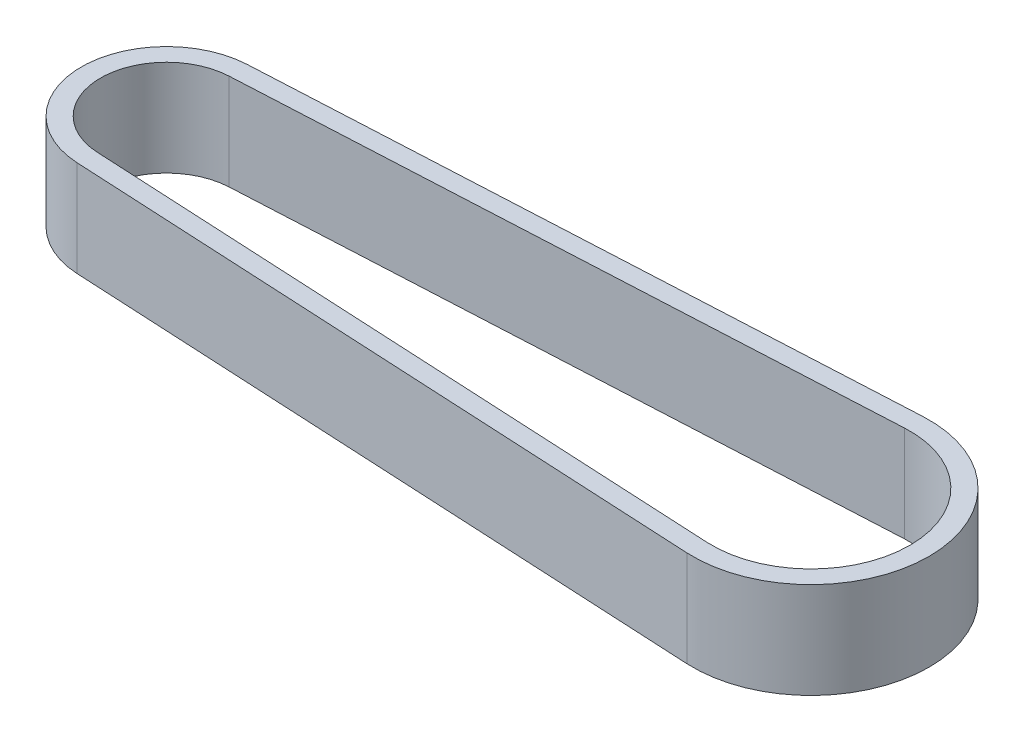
ISO-10303-21;
HEADER;
FILE_DESCRIPTION(('STEP AP214'),'2;1');
FILE_NAME('part.step','',(''),(''),'','','');
FILE_SCHEMA(('AUTOMOTIVE_DESIGN { 1 0 10303 214 1 1 1 1 }'));
ENDSEC;
DATA;
#1=APPLICATION_CONTEXT('core data for automotive mechanical design processes');
#2=APPLICATION_PROTOCOL_DEFINITION('international standard','automotive_design',2000,#1);
#3=PRODUCT_CONTEXT('',#1,'mechanical');
#4=PRODUCT('Part','Part','',(#3));
#5=PRODUCT_RELATED_PRODUCT_CATEGORY('part','',(#4));
#6=PRODUCT_DEFINITION_FORMATION('','',#4);
#7=PRODUCT_DEFINITION_CONTEXT('part definition',#1,'design');
#8=PRODUCT_DEFINITION('design','',#6,#7);
#9=PRODUCT_DEFINITION_SHAPE('','',#8);
#10=(LENGTH_UNIT() NAMED_UNIT(*) SI_UNIT(.MILLI.,.METRE.));
#11=(NAMED_UNIT(*) PLANE_ANGLE_UNIT() SI_UNIT($,.RADIAN.));
#12=(NAMED_UNIT(*) SI_UNIT($,.STERADIAN.) SOLID_ANGLE_UNIT());
#13=UNCERTAINTY_MEASURE_WITH_UNIT(LENGTH_MEASURE(1.E-05),#10,'distance_accuracy_value','');
#14=(GEOMETRIC_REPRESENTATION_CONTEXT(3) GLOBAL_UNCERTAINTY_ASSIGNED_CONTEXT((#13)) GLOBAL_UNIT_ASSIGNED_CONTEXT((#10,
#11,#12)) REPRESENTATION_CONTEXT('',''));
#15=CARTESIAN_POINT('',(0.,0.,0.));
#16=DIRECTION('',(0.,0.,1.));
#17=DIRECTION('',(1.,0.,0.));
#18=AXIS2_PLACEMENT_3D('',#15,#16,#17);
#19=CARTESIAN_POINT('',(-67.12,10.,0.));
#20=DIRECTION('',(0.,1.,0.));
#21=DIRECTION('',(0.,0.,1.));
#22=AXIS2_PLACEMENT_3D('',#19,#20,#21);
#23=PLANE('',#22);
#24=CARTESIAN_POINT('',(-67.12,10.,0.));
#25=DIRECTION('',(0.,1.,0.));
#26=DIRECTION('',(0.,0.,1.));
#27=AXIS2_PLACEMENT_3D('',#24,#25,#26);
#28=CIRCLE('',#27,17.75);
#29=CARTESIAN_POINT('',(-68.0290528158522,10.,-17.7267064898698));
#30=VERTEX_POINT('',#29);
#31=CARTESIAN_POINT('',(-68.0290528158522,10.,17.7267064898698));
#32=VERTEX_POINT('',#31);
#33=EDGE_CURVE('E142',#30,#32,#28,.T.);
#34=ORIENTED_EDGE('',*,*,#33,.T.);
#35=DIRECTION('',(0.998687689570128,0.,0.051214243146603));
#36=VECTOR('',#35,1.);
#37=CARTESIAN_POINT('',(65.8588492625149,10.,24.5926843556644));
#38=LINE('',#37,#36);
#39=CARTESIAN_POINT('',(65.8588492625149,10.,24.5926843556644));
#40=VERTEX_POINT('',#39);
#41=EDGE_CURVE('E144',#32,#40,#38,.T.);
#42=ORIENTED_EDGE('',*,*,#41,.T.);
#43=CARTESIAN_POINT('',(67.12,10.,0.));
#44=DIRECTION('',(0.,1.,0.));
#45=DIRECTION('',(0.,0.,1.));
#46=AXIS2_PLACEMENT_3D('',#43,#44,#45);
#47=CIRCLE('',#46,24.625);
#48=CARTESIAN_POINT('',(65.8588492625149,10.,-24.5926843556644));
#49=VERTEX_POINT('',#48);
#50=EDGE_CURVE('E146',#40,#49,#47,.T.);
#51=ORIENTED_EDGE('',*,*,#50,.T.);
#52=DIRECTION('',(-0.998687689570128,0.,0.0512142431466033));
#53=VECTOR('',#52,1.);
#54=CARTESIAN_POINT('',(-68.0290528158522,10.,-17.7267064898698));
#55=LINE('',#54,#53);
#56=EDGE_CURVE('E147',#49,#30,#55,.T.);
#57=ORIENTED_EDGE('',*,*,#56,.T.);
#58=EDGE_LOOP('',(#34,#42,#51,#57));
#59=FACE_BOUND('',#58,.T.);
#60=DIRECTION('',(0.998687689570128,0.,0.0512142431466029));
#61=VECTOR('',#60,1.);
#62=CARTESIAN_POINT('',(66.0637062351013,10.,20.5979335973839));
#63=LINE('',#62,#61);
#64=CARTESIAN_POINT('',(-67.8241958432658,10.,13.7319557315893));
#65=VERTEX_POINT('',#64);
#66=CARTESIAN_POINT('',(66.0637062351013,10.,20.5979335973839));
#67=VERTEX_POINT('',#66);
#68=EDGE_CURVE('E111',#65,#67,#63,.T.);
#69=ORIENTED_EDGE('',*,*,#68,.F.);
#70=CARTESIAN_POINT('',(-67.12,10.,0.));
#71=DIRECTION('',(0.,1.,0.));
#72=DIRECTION('',(0.,0.,1.));
#73=AXIS2_PLACEMENT_3D('',#70,#71,#72);
#74=CIRCLE('',#73,13.75);
#75=CARTESIAN_POINT('',(-67.8241958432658,10.,-13.7319557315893));
#76=VERTEX_POINT('',#75);
#77=EDGE_CURVE('E106',#76,#65,#74,.T.);
#78=ORIENTED_EDGE('',*,*,#77,.F.);
#79=DIRECTION('',(-0.998687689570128,0.,0.0512142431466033));
#80=VECTOR('',#79,1.);
#81=CARTESIAN_POINT('',(-67.8241958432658,10.,-13.7319557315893));
#82=LINE('',#81,#80);
#83=CARTESIAN_POINT('',(66.0637062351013,10.,-20.5979335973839));
#84=VERTEX_POINT('',#83);
#85=EDGE_CURVE('E126',#84,#76,#82,.T.);
#86=ORIENTED_EDGE('',*,*,#85,.F.);
#87=CARTESIAN_POINT('',(67.12,10.,0.));
#88=DIRECTION('',(0.,1.,0.));
#89=DIRECTION('',(0.,0.,1.));
#90=AXIS2_PLACEMENT_3D('',#87,#88,#89);
#91=CIRCLE('',#90,20.625);
#92=EDGE_CURVE('E127',#67,#84,#91,.T.);
#93=ORIENTED_EDGE('',*,*,#92,.F.);
#94=EDGE_LOOP('',(#69,#78,#86,#93));
#95=FACE_BOUND('',#94,.T.);
#96=ADVANCED_FACE('F41',(#59,#95),#23,.T.);
#97=CARTESIAN_POINT('',(-67.12,-10.,0.));
#98=DIRECTION('',(0.,1.,0.));
#99=DIRECTION('',(0.,0.,1.));
#100=AXIS2_PLACEMENT_3D('',#97,#98,#99);
#101=PLANE('',#100);
#102=CARTESIAN_POINT('',(-67.12,-10.,0.));
#103=DIRECTION('',(0.,1.,0.));
#104=DIRECTION('',(0.,0.,1.));
#105=AXIS2_PLACEMENT_3D('',#102,#103,#104);
#106=CIRCLE('',#105,17.75);
#107=CARTESIAN_POINT('',(-68.0290528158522,-10.,-17.7267064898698));
#108=VERTEX_POINT('',#107);
#109=CARTESIAN_POINT('',(-68.0290528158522,-10.,17.7267064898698));
#110=VERTEX_POINT('',#109);
#111=EDGE_CURVE('E124',#108,#110,#106,.T.);
#112=ORIENTED_EDGE('',*,*,#111,.F.);
#113=DIRECTION('',(-0.998687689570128,0.,0.0512142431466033));
#114=VECTOR('',#113,1.);
#115=CARTESIAN_POINT('',(-68.0290528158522,-10.,-17.7267064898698));
#116=LINE('',#115,#114);
#117=CARTESIAN_POINT('',(65.8588492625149,-10.,-24.5926843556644));
#118=VERTEX_POINT('',#117);
#119=EDGE_CURVE('E148',#118,#108,#116,.T.);
#120=ORIENTED_EDGE('',*,*,#119,.F.);
#121=CARTESIAN_POINT('',(67.12,-10.,0.));
#122=DIRECTION('',(0.,1.,0.));
#123=DIRECTION('',(0.,0.,1.));
#124=AXIS2_PLACEMENT_3D('',#121,#122,#123);
#125=CIRCLE('',#124,24.625);
#126=CARTESIAN_POINT('',(65.8588492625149,-10.,24.5926843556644));
#127=VERTEX_POINT('',#126);
#128=EDGE_CURVE('E160',#127,#118,#125,.T.);
#129=ORIENTED_EDGE('',*,*,#128,.F.);
#130=DIRECTION('',(0.998687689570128,0.,0.051214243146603));
#131=VECTOR('',#130,1.);
#132=CARTESIAN_POINT('',(65.8588492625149,-10.,24.5926843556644));
#133=LINE('',#132,#131);
#134=EDGE_CURVE('E154',#110,#127,#133,.T.);
#135=ORIENTED_EDGE('',*,*,#134,.F.);
#136=EDGE_LOOP('',(#112,#120,#129,#135));
#137=FACE_BOUND('',#136,.T.);
#138=CARTESIAN_POINT('',(-67.12,-10.,0.));
#139=DIRECTION('',(0.,1.,0.));
#140=DIRECTION('',(0.,0.,1.));
#141=AXIS2_PLACEMENT_3D('',#138,#139,#140);
#142=CIRCLE('',#141,13.75);
#143=CARTESIAN_POINT('',(-67.8241958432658,-10.,-13.7319557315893));
#144=VERTEX_POINT('',#143);
#145=CARTESIAN_POINT('',(-67.8241958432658,-10.,13.7319557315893));
#146=VERTEX_POINT('',#145);
#147=EDGE_CURVE('E63',#144,#146,#142,.T.);
#148=ORIENTED_EDGE('',*,*,#147,.T.);
#149=DIRECTION('',(0.998687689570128,0.,0.0512142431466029));
#150=VECTOR('',#149,1.);
#151=CARTESIAN_POINT('',(66.0637062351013,-10.,20.5979335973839));
#152=LINE('',#151,#150);
#153=CARTESIAN_POINT('',(66.0637062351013,-10.,20.5979335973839));
#154=VERTEX_POINT('',#153);
#155=EDGE_CURVE('E122',#146,#154,#152,.T.);
#156=ORIENTED_EDGE('',*,*,#155,.T.);
#157=CARTESIAN_POINT('',(67.12,-10.,0.));
#158=DIRECTION('',(0.,1.,0.));
#159=DIRECTION('',(0.,0.,1.));
#160=AXIS2_PLACEMENT_3D('',#157,#158,#159);
#161=CIRCLE('',#160,20.625);
#162=CARTESIAN_POINT('',(66.0637062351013,-10.,-20.5979335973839));
#163=VERTEX_POINT('',#162);
#164=EDGE_CURVE('E133',#154,#163,#161,.T.);
#165=ORIENTED_EDGE('',*,*,#164,.T.);
#166=DIRECTION('',(-0.998687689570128,0.,0.0512142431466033));
#167=VECTOR('',#166,1.);
#168=CARTESIAN_POINT('',(-67.8241958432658,-10.,-13.7319557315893));
#169=LINE('',#168,#167);
#170=EDGE_CURVE('E113',#163,#144,#169,.T.);
#171=ORIENTED_EDGE('',*,*,#170,.T.);
#172=EDGE_LOOP('',(#148,#156,#165,#171));
#173=FACE_BOUND('',#172,.T.);
#174=ADVANCED_FACE('F175',(#137,#173),#101,.F.);
#175=CARTESIAN_POINT('',(-67.12,10.,0.));
#176=DIRECTION('',(0.,-1.,0.));
#177=DIRECTION('',(0.,0.,-1.));
#178=AXIS2_PLACEMENT_3D('',#175,#176,#177);
#179=CYLINDRICAL_SURFACE('',#178,17.75);
#180=ORIENTED_EDGE('',*,*,#111,.T.);
#181=DIRECTION('',(0.,-1.,0.));
#182=VECTOR('',#181,1.);
#183=CARTESIAN_POINT('',(-68.0290528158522,10.,17.7267064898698));
#184=LINE('',#183,#182);
#185=EDGE_CURVE('E11',#32,#110,#184,.T.);
#186=ORIENTED_EDGE('',*,*,#185,.F.);
#187=ORIENTED_EDGE('',*,*,#33,.F.);
#188=DIRECTION('',(0.,-1.,0.));
#189=VECTOR('',#188,1.);
#190=CARTESIAN_POINT('',(-68.0290528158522,10.,-17.7267064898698));
#191=LINE('',#190,#189);
#192=EDGE_CURVE('E155',#30,#108,#191,.T.);
#193=ORIENTED_EDGE('',*,*,#192,.T.);
#194=EDGE_LOOP('',(#180,#186,#187,#193));
#195=FACE_BOUND('',#194,.T.);
#196=ADVANCED_FACE('F43',(#195),#179,.T.);
#197=CARTESIAN_POINT('',(65.8588492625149,10.,24.5926843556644));
#198=DIRECTION('',(0.051214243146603,0.,-0.998687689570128));
#199=DIRECTION('',(-0.998687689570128,0.,-0.051214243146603));
#200=AXIS2_PLACEMENT_3D('',#197,#198,#199);
#201=PLANE('',#200);
#202=ORIENTED_EDGE('',*,*,#134,.T.);
#203=DIRECTION('',(0.,-1.,0.));
#204=VECTOR('',#203,1.);
#205=CARTESIAN_POINT('',(65.8588492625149,10.,24.5926843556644));
#206=LINE('',#205,#204);
#207=EDGE_CURVE('E47',#40,#127,#206,.T.);
#208=ORIENTED_EDGE('',*,*,#207,.F.);
#209=ORIENTED_EDGE('',*,*,#41,.F.);
#210=ORIENTED_EDGE('',*,*,#185,.T.);
#211=EDGE_LOOP('',(#202,#208,#209,#210));
#212=FACE_BOUND('',#211,.T.);
#213=ADVANCED_FACE('F183',(#212),#201,.F.);
#214=CARTESIAN_POINT('',(67.12,10.,0.));
#215=DIRECTION('',(0.,-1.,0.));
#216=DIRECTION('',(0.,0.,-1.));
#217=AXIS2_PLACEMENT_3D('',#214,#215,#216);
#218=CYLINDRICAL_SURFACE('',#217,24.625);
#219=ORIENTED_EDGE('',*,*,#128,.T.);
#220=DIRECTION('',(0.,-1.,0.));
#221=VECTOR('',#220,1.);
#222=CARTESIAN_POINT('',(65.8588492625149,10.,-24.5926843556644));
#223=LINE('',#222,#221);
#224=EDGE_CURVE('E165',#49,#118,#223,.T.);
#225=ORIENTED_EDGE('',*,*,#224,.F.);
#226=ORIENTED_EDGE('',*,*,#50,.F.);
#227=ORIENTED_EDGE('',*,*,#207,.T.);
#228=EDGE_LOOP('',(#219,#225,#226,#227));
#229=FACE_BOUND('',#228,.T.);
#230=ADVANCED_FACE('F166',(#229),#218,.T.);
#231=CARTESIAN_POINT('',(-68.0290528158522,10.,-17.7267064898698));
#232=DIRECTION('',(0.0512142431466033,0.,0.998687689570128));
#233=DIRECTION('',(0.998687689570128,0.,-0.0512142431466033));
#234=AXIS2_PLACEMENT_3D('',#231,#232,#233);
#235=PLANE('',#234);
#236=ORIENTED_EDGE('',*,*,#119,.T.);
#237=ORIENTED_EDGE('',*,*,#192,.F.);
#238=ORIENTED_EDGE('',*,*,#56,.F.);
#239=ORIENTED_EDGE('',*,*,#224,.T.);
#240=EDGE_LOOP('',(#236,#237,#238,#239));
#241=FACE_BOUND('',#240,.T.);
#242=ADVANCED_FACE('F176',(#241),#235,.F.);
#243=CARTESIAN_POINT('',(-67.12,10.,0.));
#244=DIRECTION('',(0.,-1.,0.));
#245=DIRECTION('',(0.,0.,-1.));
#246=AXIS2_PLACEMENT_3D('',#243,#244,#245);
#247=CYLINDRICAL_SURFACE('',#246,13.75);
#248=ORIENTED_EDGE('',*,*,#147,.F.);
#249=DIRECTION('',(0.,-1.,0.));
#250=VECTOR('',#249,1.);
#251=CARTESIAN_POINT('',(-67.8241958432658,10.,-13.7319557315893));
#252=LINE('',#251,#250);
#253=EDGE_CURVE('E109',#76,#144,#252,.T.);
#254=ORIENTED_EDGE('',*,*,#253,.F.);
#255=ORIENTED_EDGE('',*,*,#77,.T.);
#256=DIRECTION('',(0.,-1.,0.));
#257=VECTOR('',#256,1.);
#258=CARTESIAN_POINT('',(-67.8241958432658,10.,13.7319557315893));
#259=LINE('',#258,#257);
#260=EDGE_CURVE('E108',#65,#146,#259,.T.);
#261=ORIENTED_EDGE('',*,*,#260,.T.);
#262=EDGE_LOOP('',(#248,#254,#255,#261));
#263=FACE_BOUND('',#262,.T.);
#264=ADVANCED_FACE('F107',(#263),#247,.F.);
#265=CARTESIAN_POINT('',(66.0637062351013,10.,20.5979335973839));
#266=DIRECTION('',(0.051214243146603,0.,-0.998687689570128));
#267=DIRECTION('',(-0.998687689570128,0.,-0.051214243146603));
#268=AXIS2_PLACEMENT_3D('',#265,#266,#267);
#269=PLANE('',#268);
#270=ORIENTED_EDGE('',*,*,#155,.F.);
#271=ORIENTED_EDGE('',*,*,#260,.F.);
#272=ORIENTED_EDGE('',*,*,#68,.T.);
#273=DIRECTION('',(0.,-1.,0.));
#274=VECTOR('',#273,1.);
#275=CARTESIAN_POINT('',(66.0637062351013,10.,20.5979335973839));
#276=LINE('',#275,#274);
#277=EDGE_CURVE('E125',#67,#154,#276,.T.);
#278=ORIENTED_EDGE('',*,*,#277,.T.);
#279=EDGE_LOOP('',(#270,#271,#272,#278));
#280=FACE_BOUND('',#279,.T.);
#281=ADVANCED_FACE('F119',(#280),#269,.T.);
#282=CARTESIAN_POINT('',(67.12,10.,0.));
#283=DIRECTION('',(0.,-1.,0.));
#284=DIRECTION('',(0.,0.,-1.));
#285=AXIS2_PLACEMENT_3D('',#282,#283,#284);
#286=CYLINDRICAL_SURFACE('',#285,20.625);
#287=ORIENTED_EDGE('',*,*,#164,.F.);
#288=ORIENTED_EDGE('',*,*,#277,.F.);
#289=ORIENTED_EDGE('',*,*,#92,.T.);
#290=DIRECTION('',(0.,-1.,0.));
#291=VECTOR('',#290,1.);
#292=CARTESIAN_POINT('',(66.0637062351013,10.,-20.5979335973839));
#293=LINE('',#292,#291);
#294=EDGE_CURVE('E57',#84,#163,#293,.T.);
#295=ORIENTED_EDGE('',*,*,#294,.T.);
#296=EDGE_LOOP('',(#287,#288,#289,#295));
#297=FACE_BOUND('',#296,.T.);
#298=ADVANCED_FACE('F208',(#297),#286,.F.);
#299=CARTESIAN_POINT('',(-67.8241958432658,10.,-13.7319557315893));
#300=DIRECTION('',(0.0512142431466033,0.,0.998687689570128));
#301=DIRECTION('',(0.998687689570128,0.,-0.0512142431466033));
#302=AXIS2_PLACEMENT_3D('',#299,#300,#301);
#303=PLANE('',#302);
#304=ORIENTED_EDGE('',*,*,#170,.F.);
#305=ORIENTED_EDGE('',*,*,#294,.F.);
#306=ORIENTED_EDGE('',*,*,#85,.T.);
#307=ORIENTED_EDGE('',*,*,#253,.T.);
#308=EDGE_LOOP('',(#304,#305,#306,#307));
#309=FACE_BOUND('',#308,.T.);
#310=ADVANCED_FACE('F215',(#309),#303,.T.);
#311=CLOSED_SHELL('',(#96,#174,#196,#213,#230,#242,#264,#281,#298,#310));
#312=MANIFOLD_SOLID_BREP('B2',#311);
#313=ADVANCED_BREP_SHAPE_REPRESENTATION('',(#18,#312),#14);
#314=SHAPE_DEFINITION_REPRESENTATION(#9,#313);
ENDSEC;
END-ISO-10303-21;
